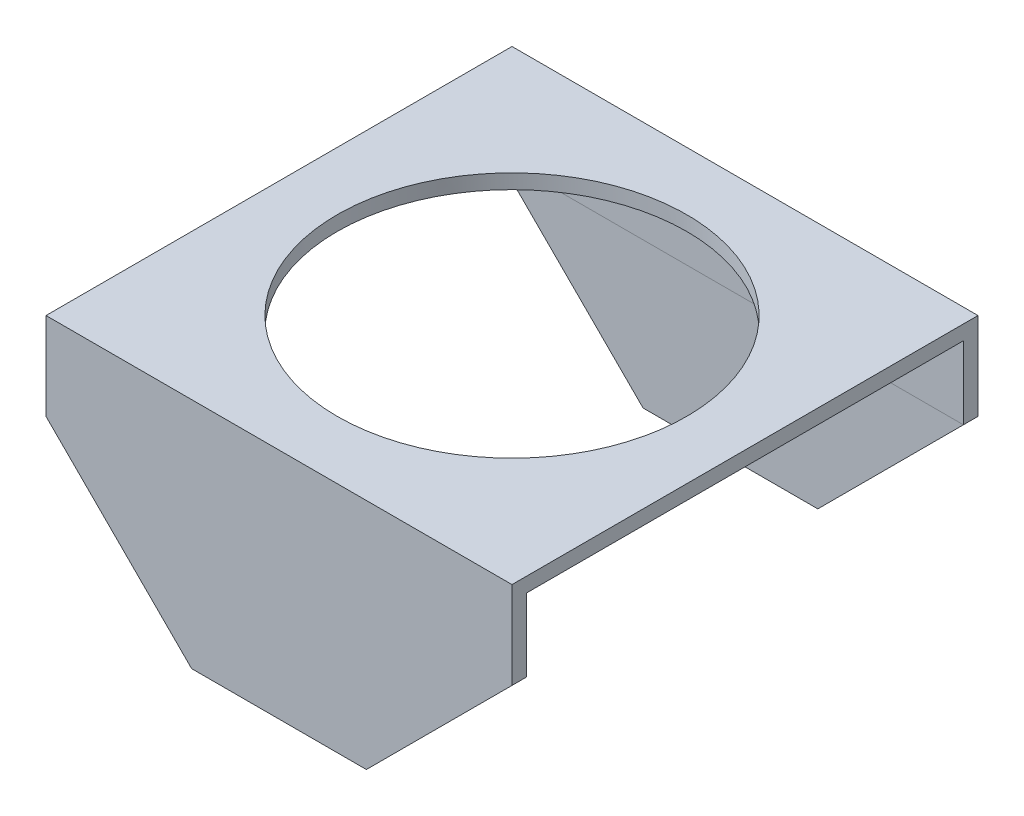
ISO-10303-21;
HEADER;
FILE_DESCRIPTION(('STEP AP214'),'2;1');
FILE_NAME('part.step','',(''),(''),'','','');
FILE_SCHEMA(('AUTOMOTIVE_DESIGN { 1 0 10303 214 1 1 1 1 }'));
ENDSEC;
DATA;
#1=APPLICATION_CONTEXT('core data for automotive mechanical design processes');
#2=APPLICATION_PROTOCOL_DEFINITION('international standard','automotive_design',2000,#1);
#3=PRODUCT_CONTEXT('',#1,'mechanical');
#4=PRODUCT('Part','Part','',(#3));
#5=PRODUCT_RELATED_PRODUCT_CATEGORY('part','',(#4));
#6=PRODUCT_DEFINITION_FORMATION('','',#4);
#7=PRODUCT_DEFINITION_CONTEXT('part definition',#1,'design');
#8=PRODUCT_DEFINITION('design','',#6,#7);
#9=PRODUCT_DEFINITION_SHAPE('','',#8);
#10=(LENGTH_UNIT() NAMED_UNIT(*) SI_UNIT(.MILLI.,.METRE.));
#11=(NAMED_UNIT(*) PLANE_ANGLE_UNIT() SI_UNIT($,.RADIAN.));
#12=(NAMED_UNIT(*) SI_UNIT($,.STERADIAN.) SOLID_ANGLE_UNIT());
#13=UNCERTAINTY_MEASURE_WITH_UNIT(LENGTH_MEASURE(1.E-05),#10,'distance_accuracy_value','');
#14=(GEOMETRIC_REPRESENTATION_CONTEXT(3) GLOBAL_UNCERTAINTY_ASSIGNED_CONTEXT((#13)) GLOBAL_UNIT_ASSIGNED_CONTEXT((#10,
#11,#12)) REPRESENTATION_CONTEXT('',''));
#15=CARTESIAN_POINT('',(0.,0.,0.));
#16=DIRECTION('',(0.,0.,1.));
#17=DIRECTION('',(1.,0.,0.));
#18=AXIS2_PLACEMENT_3D('',#15,#16,#17);
#19=CARTESIAN_POINT('',(-8.,8.,-16.));
#20=DIRECTION('',(-1.,0.,0.));
#21=DIRECTION('',(0.,0.,1.));
#22=AXIS2_PLACEMENT_3D('',#19,#20,#21);
#23=PLANE('',#22);
#24=DIRECTION('',(0.,0.,1.));
#25=VECTOR('',#24,1.);
#26=CARTESIAN_POINT('',(-8.,5.,-16.));
#27=LINE('',#26,#25);
#28=CARTESIAN_POINT('',(-8.,5.,-16.));
#29=VERTEX_POINT('',#28);
#30=CARTESIAN_POINT('',(-8.,5.,-15.5));
#31=VERTEX_POINT('',#30);
#32=EDGE_CURVE('E205',#29,#31,#27,.T.);
#33=ORIENTED_EDGE('',*,*,#32,.T.);
#34=DIRECTION('',(0.,1.,0.));
#35=VECTOR('',#34,1.);
#36=CARTESIAN_POINT('',(-8.,8.,-15.5));
#37=LINE('',#36,#35);
#38=CARTESIAN_POINT('',(-8.,7.5,-15.5));
#39=VERTEX_POINT('',#38);
#40=EDGE_CURVE('E48',#31,#39,#37,.T.);
#41=ORIENTED_EDGE('',*,*,#40,.T.);
#42=DIRECTION('',(0.,0.,1.));
#43=VECTOR('',#42,1.);
#44=CARTESIAN_POINT('',(-8.,7.5,-16.));
#45=LINE('',#44,#43);
#46=CARTESIAN_POINT('',(-8.,7.5,-0.500000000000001));
#47=VERTEX_POINT('',#46);
#48=EDGE_CURVE('E52',#39,#47,#45,.T.);
#49=ORIENTED_EDGE('',*,*,#48,.T.);
#50=DIRECTION('',(0.,-1.,0.));
#51=VECTOR('',#50,1.);
#52=CARTESIAN_POINT('',(-8.,8.,-0.5));
#53=LINE('',#52,#51);
#54=CARTESIAN_POINT('',(-8.,5.,-0.5));
#55=VERTEX_POINT('',#54);
#56=EDGE_CURVE('E188',#47,#55,#53,.T.);
#57=ORIENTED_EDGE('',*,*,#56,.T.);
#58=CARTESIAN_POINT('',(-8.,5.,0.));
#59=VERTEX_POINT('',#58);
#60=EDGE_CURVE('E208',#55,#59,#27,.T.);
#61=ORIENTED_EDGE('',*,*,#60,.T.);
#62=DIRECTION('',(0.,-1.,0.));
#63=VECTOR('',#62,1.);
#64=CARTESIAN_POINT('',(-8.,8.,0.));
#65=LINE('',#64,#63);
#66=CARTESIAN_POINT('',(-8.,8.,0.));
#67=VERTEX_POINT('',#66);
#68=EDGE_CURVE('E207',#67,#59,#65,.T.);
#69=ORIENTED_EDGE('',*,*,#68,.F.);
#70=DIRECTION('',(0.,0.,1.));
#71=VECTOR('',#70,1.);
#72=CARTESIAN_POINT('',(-8.,8.,-16.));
#73=LINE('',#72,#71);
#74=CARTESIAN_POINT('',(-8.,8.,-16.));
#75=VERTEX_POINT('',#74);
#76=EDGE_CURVE('E147',#75,#67,#73,.T.);
#77=ORIENTED_EDGE('',*,*,#76,.F.);
#78=DIRECTION('',(0.,-1.,0.));
#79=VECTOR('',#78,1.);
#80=CARTESIAN_POINT('',(-8.,8.,-16.));
#81=LINE('',#80,#79);
#82=EDGE_CURVE('E221',#75,#29,#81,.T.);
#83=ORIENTED_EDGE('',*,*,#82,.T.);
#84=EDGE_LOOP('',(#33,#41,#49,#57,#61,#69,#77,#83));
#85=FACE_BOUND('',#84,.T.);
#86=ADVANCED_FACE('F33',(#85),#23,.T.);
#87=CARTESIAN_POINT('',(8.,8.,-16.));
#88=DIRECTION('',(1.,0.,0.));
#89=DIRECTION('',(0.,0.,-1.));
#90=AXIS2_PLACEMENT_3D('',#87,#88,#89);
#91=PLANE('',#90);
#92=DIRECTION('',(0.,0.,-1.));
#93=VECTOR('',#92,1.);
#94=CARTESIAN_POINT('',(8.,7.5,-16.));
#95=LINE('',#94,#93);
#96=CARTESIAN_POINT('',(8.,7.5,-0.500000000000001));
#97=VERTEX_POINT('',#96);
#98=CARTESIAN_POINT('',(8.,7.5,-15.5));
#99=VERTEX_POINT('',#98);
#100=EDGE_CURVE('E41',#97,#99,#95,.T.);
#101=ORIENTED_EDGE('',*,*,#100,.T.);
#102=DIRECTION('',(0.,-1.,0.));
#103=VECTOR('',#102,1.);
#104=CARTESIAN_POINT('',(8.,8.,-15.5));
#105=LINE('',#104,#103);
#106=CARTESIAN_POINT('',(8.,5.,-15.5));
#107=VERTEX_POINT('',#106);
#108=EDGE_CURVE('E11',#99,#107,#105,.T.);
#109=ORIENTED_EDGE('',*,*,#108,.T.);
#110=DIRECTION('',(0.,0.,1.));
#111=VECTOR('',#110,1.);
#112=CARTESIAN_POINT('',(8.,5.,-16.));
#113=LINE('',#112,#111);
#114=CARTESIAN_POINT('',(8.,5.,-16.));
#115=VERTEX_POINT('',#114);
#116=EDGE_CURVE('E195',#115,#107,#113,.T.);
#117=ORIENTED_EDGE('',*,*,#116,.F.);
#118=DIRECTION('',(0.,1.,0.));
#119=VECTOR('',#118,1.);
#120=CARTESIAN_POINT('',(8.,8.,-16.));
#121=LINE('',#120,#119);
#122=CARTESIAN_POINT('',(8.,8.,-16.));
#123=VERTEX_POINT('',#122);
#124=EDGE_CURVE('E227',#115,#123,#121,.T.);
#125=ORIENTED_EDGE('',*,*,#124,.T.);
#126=DIRECTION('',(0.,0.,1.));
#127=VECTOR('',#126,1.);
#128=CARTESIAN_POINT('',(8.,8.,-16.));
#129=LINE('',#128,#127);
#130=CARTESIAN_POINT('',(8.,8.,0.));
#131=VERTEX_POINT('',#130);
#132=EDGE_CURVE('E152',#123,#131,#129,.T.);
#133=ORIENTED_EDGE('',*,*,#132,.T.);
#134=DIRECTION('',(0.,1.,0.));
#135=VECTOR('',#134,1.);
#136=CARTESIAN_POINT('',(8.,8.,0.));
#137=LINE('',#136,#135);
#138=CARTESIAN_POINT('',(8.,5.,0.));
#139=VERTEX_POINT('',#138);
#140=EDGE_CURVE('E216',#139,#131,#137,.T.);
#141=ORIENTED_EDGE('',*,*,#140,.F.);
#142=CARTESIAN_POINT('',(8.,5.,-0.5));
#143=VERTEX_POINT('',#142);
#144=EDGE_CURVE('E197',#143,#139,#113,.T.);
#145=ORIENTED_EDGE('',*,*,#144,.F.);
#146=DIRECTION('',(0.,1.,0.));
#147=VECTOR('',#146,1.);
#148=CARTESIAN_POINT('',(8.,8.,-0.5));
#149=LINE('',#148,#147);
#150=EDGE_CURVE('E150',#143,#97,#149,.T.);
#151=ORIENTED_EDGE('',*,*,#150,.T.);
#152=EDGE_LOOP('',(#101,#109,#117,#125,#133,#141,#145,#151));
#153=FACE_BOUND('',#152,.T.);
#154=ADVANCED_FACE('F160',(#153),#91,.T.);
#155=CARTESIAN_POINT('',(-8.,0.,-16.));
#156=DIRECTION('',(0.,-1.,0.));
#157=DIRECTION('',(1.,0.,0.));
#158=AXIS2_PLACEMENT_3D('',#155,#156,#157);
#159=PLANE('',#158);
#160=DIRECTION('',(0.,0.,1.));
#161=VECTOR('',#160,1.);
#162=CARTESIAN_POINT('',(3.,0.,-16.));
#163=LINE('',#162,#161);
#164=CARTESIAN_POINT('',(3.,0.,-16.));
#165=VERTEX_POINT('',#164);
#166=CARTESIAN_POINT('',(3.,0.,-15.5));
#167=VERTEX_POINT('',#166);
#168=EDGE_CURVE('E130',#165,#167,#163,.T.);
#169=ORIENTED_EDGE('',*,*,#168,.T.);
#170=DIRECTION('',(-1.,0.,0.));
#171=VECTOR('',#170,1.);
#172=CARTESIAN_POINT('',(58.,0.,-15.5));
#173=LINE('',#172,#171);
#174=CARTESIAN_POINT('',(-3.,0.,-15.5));
#175=VERTEX_POINT('',#174);
#176=EDGE_CURVE('E177',#167,#175,#173,.T.);
#177=ORIENTED_EDGE('',*,*,#176,.T.);
#178=DIRECTION('',(0.,0.,1.));
#179=VECTOR('',#178,1.);
#180=CARTESIAN_POINT('',(-3.,0.,-16.));
#181=LINE('',#180,#179);
#182=CARTESIAN_POINT('',(-3.,0.,-16.));
#183=VERTEX_POINT('',#182);
#184=EDGE_CURVE('E209',#183,#175,#181,.T.);
#185=ORIENTED_EDGE('',*,*,#184,.F.);
#186=DIRECTION('',(1.,0.,0.));
#187=VECTOR('',#186,1.);
#188=CARTESIAN_POINT('',(-8.,0.,-16.));
#189=LINE('',#188,#187);
#190=EDGE_CURVE('E224',#183,#165,#189,.T.);
#191=ORIENTED_EDGE('',*,*,#190,.T.);
#192=EDGE_LOOP('',(#169,#177,#185,#191));
#193=FACE_BOUND('',#192,.T.);
#194=ADVANCED_FACE('F272',(#193),#159,.T.);
#195=CARTESIAN_POINT('',(-3.,0.,-0.5));
#196=VERTEX_POINT('',#195);
#197=CARTESIAN_POINT('',(-3.,0.,0.));
#198=VERTEX_POINT('',#197);
#199=EDGE_CURVE('E137',#196,#198,#181,.T.);
#200=ORIENTED_EDGE('',*,*,#199,.F.);
#201=DIRECTION('',(-1.,0.,0.));
#202=VECTOR('',#201,1.);
#203=CARTESIAN_POINT('',(58.,0.,-0.5));
#204=LINE('',#203,#202);
#205=CARTESIAN_POINT('',(3.00000000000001,0.,-0.5));
#206=VERTEX_POINT('',#205);
#207=EDGE_CURVE('E135',#206,#196,#204,.T.);
#208=ORIENTED_EDGE('',*,*,#207,.F.);
#209=CARTESIAN_POINT('',(3.,0.,0.));
#210=VERTEX_POINT('',#209);
#211=EDGE_CURVE('E119',#206,#210,#163,.T.);
#212=ORIENTED_EDGE('',*,*,#211,.T.);
#213=DIRECTION('',(1.,0.,0.));
#214=VECTOR('',#213,1.);
#215=CARTESIAN_POINT('',(-8.,0.,0.));
#216=LINE('',#215,#214);
#217=EDGE_CURVE('E214',#198,#210,#216,.T.);
#218=ORIENTED_EDGE('',*,*,#217,.F.);
#219=EDGE_LOOP('',(#200,#208,#212,#218));
#220=FACE_BOUND('',#219,.T.);
#221=ADVANCED_FACE('F136',(#220),#159,.T.);
#222=CARTESIAN_POINT('',(-8.,5.,-16.));
#223=DIRECTION('',(0.707106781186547,0.707106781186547,0.));
#224=DIRECTION('',(-0.707106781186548,0.707106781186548,0.));
#225=AXIS2_PLACEMENT_3D('',#222,#223,#224);
#226=PLANE('',#225);
#227=DIRECTION('',(0.707106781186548,-0.707106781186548,0.));
#228=VECTOR('',#227,1.);
#229=CARTESIAN_POINT('',(-8.,5.,-15.5));
#230=LINE('',#229,#228);
#231=EDGE_CURVE('E185',#31,#175,#230,.T.);
#232=ORIENTED_EDGE('',*,*,#231,.F.);
#233=ORIENTED_EDGE('',*,*,#32,.F.);
#234=DIRECTION('',(-0.707106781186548,0.707106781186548,0.));
#235=VECTOR('',#234,1.);
#236=CARTESIAN_POINT('',(-8.,5.,-16.));
#237=LINE('',#236,#235);
#238=EDGE_CURVE('E202',#183,#29,#237,.T.);
#239=ORIENTED_EDGE('',*,*,#238,.F.);
#240=ORIENTED_EDGE('',*,*,#184,.T.);
#241=EDGE_LOOP('',(#232,#233,#239,#240));
#242=FACE_BOUND('',#241,.T.);
#243=ADVANCED_FACE('F282',(#242),#226,.F.);
#244=DIRECTION('',(-0.707106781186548,0.707106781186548,0.));
#245=VECTOR('',#244,1.);
#246=CARTESIAN_POINT('',(-8.,5.,-0.5));
#247=LINE('',#246,#245);
#248=EDGE_CURVE('E182',#196,#55,#247,.T.);
#249=ORIENTED_EDGE('',*,*,#248,.F.);
#250=ORIENTED_EDGE('',*,*,#199,.T.);
#251=DIRECTION('',(-0.707106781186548,0.707106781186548,0.));
#252=VECTOR('',#251,1.);
#253=CARTESIAN_POINT('',(-8.,5.,0.));
#254=LINE('',#253,#252);
#255=EDGE_CURVE('E196',#198,#59,#254,.T.);
#256=ORIENTED_EDGE('',*,*,#255,.T.);
#257=ORIENTED_EDGE('',*,*,#60,.F.);
#258=EDGE_LOOP('',(#249,#250,#256,#257));
#259=FACE_BOUND('',#258,.T.);
#260=ADVANCED_FACE('F245',(#259),#226,.F.);
#261=CARTESIAN_POINT('',(8.,5.,-16.));
#262=DIRECTION('',(-0.707106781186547,0.707106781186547,0.));
#263=DIRECTION('',(-0.707106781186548,-0.707106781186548,0.));
#264=AXIS2_PLACEMENT_3D('',#261,#262,#263);
#265=PLANE('',#264);
#266=DIRECTION('',(0.707106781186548,0.707106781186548,0.));
#267=VECTOR('',#266,1.);
#268=CARTESIAN_POINT('',(8.,5.,-15.5));
#269=LINE('',#268,#267);
#270=EDGE_CURVE('E146',#167,#107,#269,.T.);
#271=ORIENTED_EDGE('',*,*,#270,.F.);
#272=ORIENTED_EDGE('',*,*,#168,.F.);
#273=DIRECTION('',(-0.707106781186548,-0.707106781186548,0.));
#274=VECTOR('',#273,1.);
#275=CARTESIAN_POINT('',(8.,5.,-16.));
#276=LINE('',#275,#274);
#277=EDGE_CURVE('E131',#115,#165,#276,.T.);
#278=ORIENTED_EDGE('',*,*,#277,.F.);
#279=ORIENTED_EDGE('',*,*,#116,.T.);
#280=EDGE_LOOP('',(#271,#272,#278,#279));
#281=FACE_BOUND('',#280,.T.);
#282=ADVANCED_FACE('F265',(#281),#265,.F.);
#283=DIRECTION('',(-0.707106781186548,-0.707106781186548,0.));
#284=VECTOR('',#283,1.);
#285=CARTESIAN_POINT('',(8.,5.,-0.5));
#286=LINE('',#285,#284);
#287=EDGE_CURVE('E123',#143,#206,#286,.T.);
#288=ORIENTED_EDGE('',*,*,#287,.F.);
#289=ORIENTED_EDGE('',*,*,#144,.T.);
#290=DIRECTION('',(-0.707106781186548,-0.707106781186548,0.));
#291=VECTOR('',#290,1.);
#292=CARTESIAN_POINT('',(8.,5.,0.));
#293=LINE('',#292,#291);
#294=EDGE_CURVE('E126',#139,#210,#293,.T.);
#295=ORIENTED_EDGE('',*,*,#294,.T.);
#296=ORIENTED_EDGE('',*,*,#211,.F.);
#297=EDGE_LOOP('',(#288,#289,#295,#296));
#298=FACE_BOUND('',#297,.T.);
#299=ADVANCED_FACE('F121',(#298),#265,.F.);
#300=CARTESIAN_POINT('',(-8.,8.,-16.));
#301=DIRECTION('',(0.,1.,0.));
#302=DIRECTION('',(0.,0.,1.));
#303=AXIS2_PLACEMENT_3D('',#300,#301,#302);
#304=PLANE('',#303);
#305=CARTESIAN_POINT('',(0.,8.,-8.));
#306=DIRECTION('',(0.,1.,0.));
#307=DIRECTION('',(0.,0.,1.));
#308=AXIS2_PLACEMENT_3D('',#305,#306,#307);
#309=CIRCLE('',#308,6.);
#310=CARTESIAN_POINT('',(0.,8.,-2.));
#311=VERTEX_POINT('',#310);
#312=EDGE_CURVE('E249',#311,#311,#309,.T.);
#313=ORIENTED_EDGE('',*,*,#312,.F.);
#314=EDGE_LOOP('',(#313));
#315=FACE_BOUND('',#314,.T.);
#316=DIRECTION('',(-1.,0.,0.));
#317=VECTOR('',#316,1.);
#318=CARTESIAN_POINT('',(-8.,8.,0.));
#319=LINE('',#318,#317);
#320=EDGE_CURVE('E218',#131,#67,#319,.T.);
#321=ORIENTED_EDGE('',*,*,#320,.F.);
#322=ORIENTED_EDGE('',*,*,#132,.F.);
#323=DIRECTION('',(-1.,0.,0.));
#324=VECTOR('',#323,1.);
#325=CARTESIAN_POINT('',(-8.,8.,-16.));
#326=LINE('',#325,#324);
#327=EDGE_CURVE('E229',#123,#75,#326,.T.);
#328=ORIENTED_EDGE('',*,*,#327,.T.);
#329=ORIENTED_EDGE('',*,*,#76,.T.);
#330=EDGE_LOOP('',(#321,#322,#328,#329));
#331=FACE_BOUND('',#330,.T.);
#332=ADVANCED_FACE('F238',(#315,#331),#304,.T.);
#333=CARTESIAN_POINT('',(-8.,8.,-16.));
#334=DIRECTION('',(0.,0.,1.));
#335=DIRECTION('',(1.,0.,0.));
#336=AXIS2_PLACEMENT_3D('',#333,#334,#335);
#337=PLANE('',#336);
#338=ORIENTED_EDGE('',*,*,#124,.F.);
#339=ORIENTED_EDGE('',*,*,#277,.T.);
#340=ORIENTED_EDGE('',*,*,#190,.F.);
#341=ORIENTED_EDGE('',*,*,#238,.T.);
#342=ORIENTED_EDGE('',*,*,#82,.F.);
#343=ORIENTED_EDGE('',*,*,#327,.F.);
#344=EDGE_LOOP('',(#338,#339,#340,#341,#342,#343));
#345=FACE_BOUND('',#344,.T.);
#346=ADVANCED_FACE('F257',(#345),#337,.F.);
#347=CARTESIAN_POINT('',(-8.,8.,0.));
#348=DIRECTION('',(0.,0.,1.));
#349=DIRECTION('',(1.,0.,0.));
#350=AXIS2_PLACEMENT_3D('',#347,#348,#349);
#351=PLANE('',#350);
#352=ORIENTED_EDGE('',*,*,#294,.F.);
#353=ORIENTED_EDGE('',*,*,#140,.T.);
#354=ORIENTED_EDGE('',*,*,#320,.T.);
#355=ORIENTED_EDGE('',*,*,#68,.T.);
#356=ORIENTED_EDGE('',*,*,#255,.F.);
#357=ORIENTED_EDGE('',*,*,#217,.T.);
#358=EDGE_LOOP('',(#352,#353,#354,#355,#356,#357));
#359=FACE_BOUND('',#358,.T.);
#360=ADVANCED_FACE('F241',(#359),#351,.T.);
#361=CARTESIAN_POINT('',(58.,5.,-15.5));
#362=DIRECTION('',(0.,0.,1.));
#363=DIRECTION('',(1.,0.,0.));
#364=AXIS2_PLACEMENT_3D('',#361,#362,#363);
#365=PLANE('',#364);
#366=DIRECTION('',(-1.,0.,0.));
#367=VECTOR('',#366,1.);
#368=CARTESIAN_POINT('',(58.,5.,-15.5));
#369=LINE('',#368,#367);
#370=EDGE_CURVE('E174',#107,#31,#369,.T.);
#371=ORIENTED_EDGE('',*,*,#370,.T.);
#372=ORIENTED_EDGE('',*,*,#231,.T.);
#373=ORIENTED_EDGE('',*,*,#176,.F.);
#374=ORIENTED_EDGE('',*,*,#270,.T.);
#375=EDGE_LOOP('',(#371,#372,#373,#374));
#376=FACE_BOUND('',#375,.T.);
#377=ADVANCED_FACE('F276',(#376),#365,.T.);
#378=CARTESIAN_POINT('',(58.,5.,-0.5));
#379=DIRECTION('',(0.,0.,-1.));
#380=DIRECTION('',(-1.,0.,0.));
#381=AXIS2_PLACEMENT_3D('',#378,#379,#380);
#382=PLANE('',#381);
#383=ORIENTED_EDGE('',*,*,#207,.T.);
#384=ORIENTED_EDGE('',*,*,#248,.T.);
#385=DIRECTION('',(-1.,0.,0.));
#386=VECTOR('',#385,1.);
#387=CARTESIAN_POINT('',(58.,5.,-0.5));
#388=LINE('',#387,#386);
#389=EDGE_CURVE('E141',#143,#55,#388,.T.);
#390=ORIENTED_EDGE('',*,*,#389,.F.);
#391=ORIENTED_EDGE('',*,*,#287,.T.);
#392=EDGE_LOOP('',(#383,#384,#390,#391));
#393=FACE_BOUND('',#392,.T.);
#394=ADVANCED_FACE('F144',(#393),#382,.T.);
#395=CARTESIAN_POINT('',(58.,7.5,-15.5));
#396=DIRECTION('',(0.,0.,1.));
#397=DIRECTION('',(1.,0.,0.));
#398=AXIS2_PLACEMENT_3D('',#395,#396,#397);
#399=PLANE('',#398);
#400=ORIENTED_EDGE('',*,*,#40,.F.);
#401=ORIENTED_EDGE('',*,*,#370,.F.);
#402=ORIENTED_EDGE('',*,*,#108,.F.);
#403=DIRECTION('',(-1.,0.,0.));
#404=VECTOR('',#403,1.);
#405=CARTESIAN_POINT('',(58.,7.5,-15.5));
#406=LINE('',#405,#404);
#407=EDGE_CURVE('E172',#99,#39,#406,.T.);
#408=ORIENTED_EDGE('',*,*,#407,.T.);
#409=EDGE_LOOP('',(#400,#401,#402,#408));
#410=FACE_BOUND('',#409,.T.);
#411=ADVANCED_FACE('F171',(#410),#399,.T.);
#412=CARTESIAN_POINT('',(58.,7.5,-0.5));
#413=DIRECTION('',(0.,-1.,0.));
#414=DIRECTION('',(0.,0.,-1.));
#415=AXIS2_PLACEMENT_3D('',#412,#413,#414);
#416=PLANE('',#415);
#417=CARTESIAN_POINT('',(0.,7.5,-8.));
#418=DIRECTION('',(0.,-1.,0.));
#419=DIRECTION('',(0.,0.,-1.));
#420=AXIS2_PLACEMENT_3D('',#417,#418,#419);
#421=CIRCLE('',#420,6.);
#422=CARTESIAN_POINT('',(0.,7.5,-14.));
#423=VERTEX_POINT('',#422);
#424=EDGE_CURVE('E36',#423,#423,#421,.T.);
#425=ORIENTED_EDGE('',*,*,#424,.F.);
#426=EDGE_LOOP('',(#425));
#427=FACE_BOUND('',#426,.T.);
#428=ORIENTED_EDGE('',*,*,#48,.F.);
#429=ORIENTED_EDGE('',*,*,#407,.F.);
#430=ORIENTED_EDGE('',*,*,#100,.F.);
#431=DIRECTION('',(-1.,0.,0.));
#432=VECTOR('',#431,1.);
#433=CARTESIAN_POINT('',(58.,7.5,-0.5));
#434=LINE('',#433,#432);
#435=EDGE_CURVE('E140',#97,#47,#434,.T.);
#436=ORIENTED_EDGE('',*,*,#435,.T.);
#437=EDGE_LOOP('',(#428,#429,#430,#436));
#438=FACE_BOUND('',#437,.T.);
#439=ADVANCED_FACE('F175',(#427,#438),#416,.T.);
#440=CARTESIAN_POINT('',(58.,7.5,-0.5));
#441=DIRECTION('',(0.,0.,-1.));
#442=DIRECTION('',(0.,1.,0.));
#443=AXIS2_PLACEMENT_3D('',#440,#441,#442);
#444=PLANE('',#443);
#445=ORIENTED_EDGE('',*,*,#56,.F.);
#446=ORIENTED_EDGE('',*,*,#435,.F.);
#447=ORIENTED_EDGE('',*,*,#150,.F.);
#448=ORIENTED_EDGE('',*,*,#389,.T.);
#449=EDGE_LOOP('',(#445,#446,#447,#448));
#450=FACE_BOUND('',#449,.T.);
#451=ADVANCED_FACE('F247',(#450),#444,.T.);
#452=CARTESIAN_POINT('',(0.,-8.,-8.));
#453=DIRECTION('',(0.,1.,0.));
#454=DIRECTION('',(0.,0.,1.));
#455=AXIS2_PLACEMENT_3D('',#452,#453,#454);
#456=CYLINDRICAL_SURFACE('',#455,6.);
#457=ORIENTED_EDGE('',*,*,#424,.T.);
#458=EDGE_LOOP('',(#457));
#459=FACE_BOUND('',#458,.T.);
#460=ORIENTED_EDGE('',*,*,#312,.T.);
#461=EDGE_LOOP('',(#460));
#462=FACE_BOUND('',#461,.T.);
#463=ADVANCED_FACE('F254',(#459,#462),#456,.F.);
#464=CLOSED_SHELL('',(#86,#154,#194,#221,#243,#260,#282,#299,#332,#346,#360,#377,#394,#411,#439,
#451,#463));
#465=MANIFOLD_SOLID_BREP('B2',#464);
#466=ADVANCED_BREP_SHAPE_REPRESENTATION('',(#18,#465),#14);
#467=SHAPE_DEFINITION_REPRESENTATION(#9,#466);
ENDSEC;
END-ISO-10303-21;
